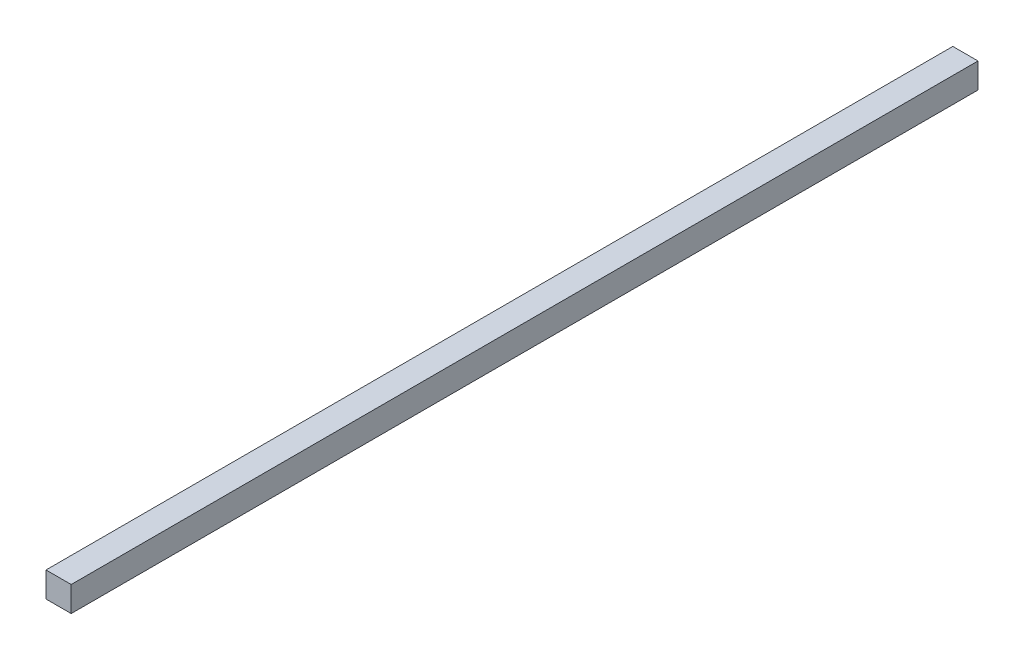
from build123d import *

# Parameters (mm, degrees)
SKETCH1_W           = 6.35
SKETCH1_H           = 228.6
BOSS_EXTRUDE1_DEPTH = 6.35


with BuildPart() as part:
    # Sketch1 → Boss-Extrude1 (new body)
    with BuildSketch(Plane(origin=(0, 6.35, 0), x_dir=(-1, 0, 0), z_dir=(0, 1, 0))):
        with Locations((-3.175, 114.3)):
            Rectangle(SKETCH1_W, SKETCH1_H)
    extrude(amount=-BOSS_EXTRUDE1_DEPTH)


solid = part.part
